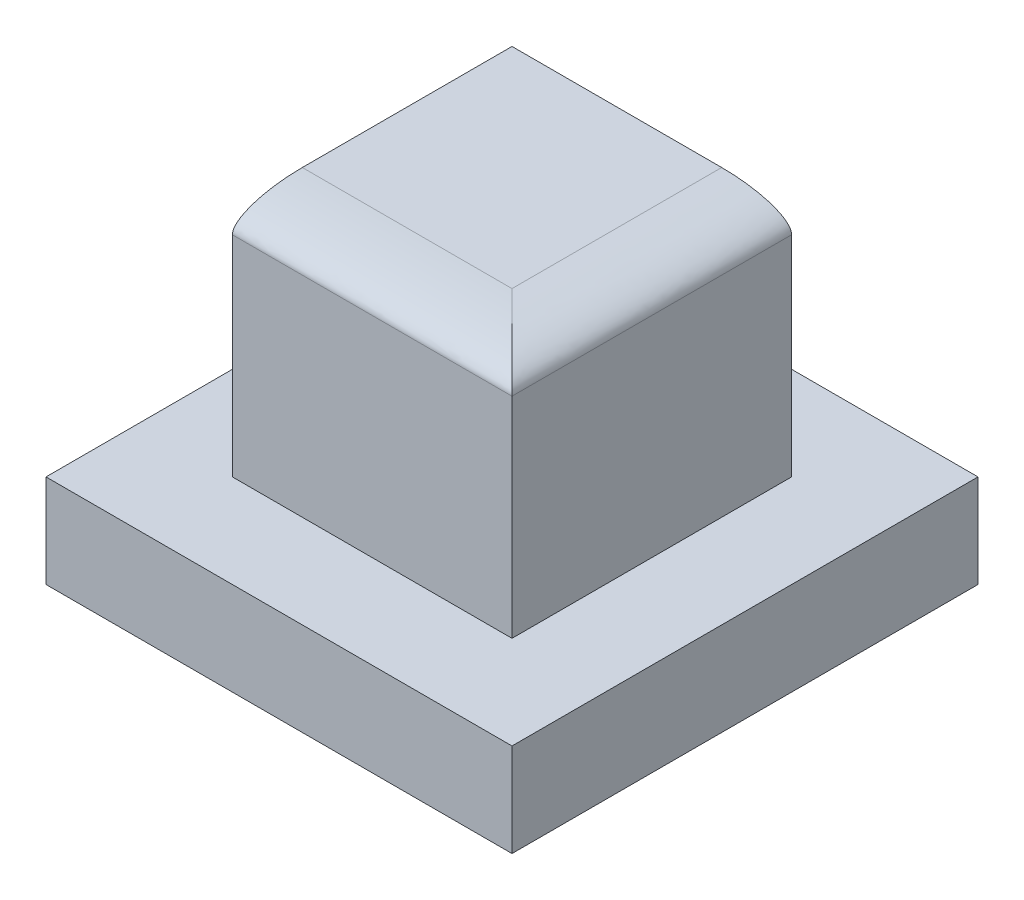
ISO-10303-21;
HEADER;
FILE_DESCRIPTION(('STEP AP214'),'2;1');
FILE_NAME('part.step','',(''),(''),'','','');
FILE_SCHEMA(('AUTOMOTIVE_DESIGN { 1 0 10303 214 1 1 1 1 }'));
ENDSEC;
DATA;
#1=APPLICATION_CONTEXT('core data for automotive mechanical design processes');
#2=APPLICATION_PROTOCOL_DEFINITION('international standard','automotive_design',2000,#1);
#3=PRODUCT_CONTEXT('',#1,'mechanical');
#4=PRODUCT('Part','Part','',(#3));
#5=PRODUCT_RELATED_PRODUCT_CATEGORY('part','',(#4));
#6=PRODUCT_DEFINITION_FORMATION('','',#4);
#7=PRODUCT_DEFINITION_CONTEXT('part definition',#1,'design');
#8=PRODUCT_DEFINITION('design','',#6,#7);
#9=PRODUCT_DEFINITION_SHAPE('','',#8);
#10=(LENGTH_UNIT() NAMED_UNIT(*) SI_UNIT(.MILLI.,.METRE.));
#11=(NAMED_UNIT(*) PLANE_ANGLE_UNIT() SI_UNIT($,.RADIAN.));
#12=(NAMED_UNIT(*) SI_UNIT($,.STERADIAN.) SOLID_ANGLE_UNIT());
#13=UNCERTAINTY_MEASURE_WITH_UNIT(LENGTH_MEASURE(1.E-05),#10,'distance_accuracy_value','');
#14=(GEOMETRIC_REPRESENTATION_CONTEXT(3) GLOBAL_UNCERTAINTY_ASSIGNED_CONTEXT((#13)) GLOBAL_UNIT_ASSIGNED_CONTEXT((#10,
#11,#12)) REPRESENTATION_CONTEXT('',''));
#15=CARTESIAN_POINT('',(0.,0.,0.));
#16=DIRECTION('',(0.,0.,1.));
#17=DIRECTION('',(1.,0.,0.));
#18=AXIS2_PLACEMENT_3D('',#15,#16,#17);
#19=CARTESIAN_POINT('',(-50.,20.,50.));
#20=DIRECTION('',(0.,-1.,0.));
#21=DIRECTION('',(1.,0.,0.));
#22=AXIS2_PLACEMENT_3D('',#19,#20,#21);
#23=PLANE('',#22);
#24=DIRECTION('',(-1.,0.,0.));
#25=VECTOR('',#24,1.);
#26=CARTESIAN_POINT('',(-50.,20.,-50.));
#27=LINE('',#26,#25);
#28=CARTESIAN_POINT('',(50.,20.,-50.));
#29=VERTEX_POINT('',#28);
#30=CARTESIAN_POINT('',(-50.,20.,-50.));
#31=VERTEX_POINT('',#30);
#32=EDGE_CURVE('E309',#29,#31,#27,.T.);
#33=ORIENTED_EDGE('',*,*,#32,.T.);
#34=DIRECTION('',(0.,0.,-1.));
#35=VECTOR('',#34,1.);
#36=CARTESIAN_POINT('',(-50.,20.,50.));
#37=LINE('',#36,#35);
#38=CARTESIAN_POINT('',(-50.,20.,50.));
#39=VERTEX_POINT('',#38);
#40=EDGE_CURVE('E297',#39,#31,#37,.T.);
#41=ORIENTED_EDGE('',*,*,#40,.F.);
#42=DIRECTION('',(-1.,0.,0.));
#43=VECTOR('',#42,1.);
#44=CARTESIAN_POINT('',(-50.,20.,50.));
#45=LINE('',#44,#43);
#46=CARTESIAN_POINT('',(50.,20.,50.));
#47=VERTEX_POINT('',#46);
#48=EDGE_CURVE('E300',#47,#39,#45,.T.);
#49=ORIENTED_EDGE('',*,*,#48,.F.);
#50=DIRECTION('',(0.,0.,-1.));
#51=VECTOR('',#50,1.);
#52=CARTESIAN_POINT('',(50.,20.,50.));
#53=LINE('',#52,#51);
#54=EDGE_CURVE('E292',#47,#29,#53,.T.);
#55=ORIENTED_EDGE('',*,*,#54,.T.);
#56=EDGE_LOOP('',(#33,#41,#49,#55));
#57=FACE_BOUND('',#56,.T.);
#58=DIRECTION('',(0.,0.,-1.));
#59=VECTOR('',#58,1.);
#60=CARTESIAN_POINT('',(30.,20.,30.));
#61=LINE('',#60,#59);
#62=CARTESIAN_POINT('',(30.,20.,30.));
#63=VERTEX_POINT('',#62);
#64=CARTESIAN_POINT('',(30.,20.,-30.));
#65=VERTEX_POINT('',#64);
#66=EDGE_CURVE('E156',#63,#65,#61,.T.);
#67=ORIENTED_EDGE('',*,*,#66,.F.);
#68=DIRECTION('',(1.,0.,0.));
#69=VECTOR('',#68,1.);
#70=CARTESIAN_POINT('',(30.,20.,30.));
#71=LINE('',#70,#69);
#72=CARTESIAN_POINT('',(-30.,20.,30.));
#73=VERTEX_POINT('',#72);
#74=EDGE_CURVE('E129',#73,#63,#71,.T.);
#75=ORIENTED_EDGE('',*,*,#74,.F.);
#76=DIRECTION('',(0.,0.,1.));
#77=VECTOR('',#76,1.);
#78=CARTESIAN_POINT('',(-30.,20.,30.));
#79=LINE('',#78,#77);
#80=CARTESIAN_POINT('',(-30.,20.,-30.));
#81=VERTEX_POINT('',#80);
#82=EDGE_CURVE('E161',#81,#73,#79,.T.);
#83=ORIENTED_EDGE('',*,*,#82,.F.);
#84=DIRECTION('',(-1.,0.,0.));
#85=VECTOR('',#84,1.);
#86=CARTESIAN_POINT('',(30.,20.,-30.));
#87=LINE('',#86,#85);
#88=EDGE_CURVE('E136',#65,#81,#87,.T.);
#89=ORIENTED_EDGE('',*,*,#88,.F.);
#90=EDGE_LOOP('',(#67,#75,#83,#89));
#91=FACE_BOUND('',#90,.T.);
#92=ADVANCED_FACE('F37',(#57,#91),#23,.F.);
#93=CARTESIAN_POINT('',(-50.,20.,50.));
#94=DIRECTION('',(1.,0.,0.));
#95=DIRECTION('',(0.,1.,0.));
#96=AXIS2_PLACEMENT_3D('',#93,#94,#95);
#97=PLANE('',#96);
#98=DIRECTION('',(0.,-1.,0.));
#99=VECTOR('',#98,1.);
#100=CARTESIAN_POINT('',(-50.,20.,-50.));
#101=LINE('',#100,#99);
#102=CARTESIAN_POINT('',(-50.,0.,-50.));
#103=VERTEX_POINT('',#102);
#104=EDGE_CURVE('E315',#31,#103,#101,.T.);
#105=ORIENTED_EDGE('',*,*,#104,.T.);
#106=DIRECTION('',(0.,0.,-1.));
#107=VECTOR('',#106,1.);
#108=CARTESIAN_POINT('',(-50.,0.,50.));
#109=LINE('',#108,#107);
#110=CARTESIAN_POINT('',(-50.,0.,50.));
#111=VERTEX_POINT('',#110);
#112=EDGE_CURVE('E286',#111,#103,#109,.T.);
#113=ORIENTED_EDGE('',*,*,#112,.F.);
#114=DIRECTION('',(0.,-1.,0.));
#115=VECTOR('',#114,1.);
#116=CARTESIAN_POINT('',(-50.,20.,50.));
#117=LINE('',#116,#115);
#118=EDGE_CURVE('E306',#39,#111,#117,.T.);
#119=ORIENTED_EDGE('',*,*,#118,.F.);
#120=ORIENTED_EDGE('',*,*,#40,.T.);
#121=EDGE_LOOP('',(#105,#113,#119,#120));
#122=FACE_BOUND('',#121,.T.);
#123=ADVANCED_FACE('F200',(#122),#97,.F.);
#124=CARTESIAN_POINT('',(-50.,0.,50.));
#125=DIRECTION('',(0.,1.,0.));
#126=DIRECTION('',(0.,0.,1.));
#127=AXIS2_PLACEMENT_3D('',#124,#125,#126);
#128=PLANE('',#127);
#129=DIRECTION('',(1.,0.,0.));
#130=VECTOR('',#129,1.);
#131=CARTESIAN_POINT('',(-50.,0.,-50.));
#132=LINE('',#131,#130);
#133=CARTESIAN_POINT('',(50.,0.,-50.));
#134=VERTEX_POINT('',#133);
#135=EDGE_CURVE('E313',#103,#134,#132,.T.);
#136=ORIENTED_EDGE('',*,*,#135,.T.);
#137=DIRECTION('',(0.,0.,-1.));
#138=VECTOR('',#137,1.);
#139=CARTESIAN_POINT('',(50.,0.,50.));
#140=LINE('',#139,#138);
#141=CARTESIAN_POINT('',(50.,0.,50.));
#142=VERTEX_POINT('',#141);
#143=EDGE_CURVE('E288',#142,#134,#140,.T.);
#144=ORIENTED_EDGE('',*,*,#143,.F.);
#145=DIRECTION('',(1.,0.,0.));
#146=VECTOR('',#145,1.);
#147=CARTESIAN_POINT('',(-50.,0.,50.));
#148=LINE('',#147,#146);
#149=EDGE_CURVE('E304',#111,#142,#148,.T.);
#150=ORIENTED_EDGE('',*,*,#149,.F.);
#151=ORIENTED_EDGE('',*,*,#112,.T.);
#152=EDGE_LOOP('',(#136,#144,#150,#151));
#153=FACE_BOUND('',#152,.T.);
#154=ADVANCED_FACE('F204',(#153),#128,.F.);
#155=CARTESIAN_POINT('',(50.,20.,50.));
#156=DIRECTION('',(-1.,0.,0.));
#157=DIRECTION('',(0.,0.,1.));
#158=AXIS2_PLACEMENT_3D('',#155,#156,#157);
#159=PLANE('',#158);
#160=DIRECTION('',(0.,1.,0.));
#161=VECTOR('',#160,1.);
#162=CARTESIAN_POINT('',(50.,20.,-50.));
#163=LINE('',#162,#161);
#164=EDGE_CURVE('E311',#134,#29,#163,.T.);
#165=ORIENTED_EDGE('',*,*,#164,.T.);
#166=ORIENTED_EDGE('',*,*,#54,.F.);
#167=DIRECTION('',(0.,1.,0.));
#168=VECTOR('',#167,1.);
#169=CARTESIAN_POINT('',(50.,20.,50.));
#170=LINE('',#169,#168);
#171=EDGE_CURVE('E302',#142,#47,#170,.T.);
#172=ORIENTED_EDGE('',*,*,#171,.F.);
#173=ORIENTED_EDGE('',*,*,#143,.T.);
#174=EDGE_LOOP('',(#165,#166,#172,#173));
#175=FACE_BOUND('',#174,.T.);
#176=ADVANCED_FACE('F196',(#175),#159,.F.);
#177=CARTESIAN_POINT('',(-50.,20.,50.));
#178=DIRECTION('',(0.,0.,1.));
#179=DIRECTION('',(1.,0.,0.));
#180=AXIS2_PLACEMENT_3D('',#177,#178,#179);
#181=PLANE('',#180);
#182=ORIENTED_EDGE('',*,*,#118,.T.);
#183=ORIENTED_EDGE('',*,*,#149,.T.);
#184=ORIENTED_EDGE('',*,*,#171,.T.);
#185=ORIENTED_EDGE('',*,*,#48,.T.);
#186=EDGE_LOOP('',(#182,#183,#184,#185));
#187=FACE_BOUND('',#186,.T.);
#188=ADVANCED_FACE('F192',(#187),#181,.T.);
#189=CARTESIAN_POINT('',(-50.,20.,-50.));
#190=DIRECTION('',(0.,0.,1.));
#191=DIRECTION('',(1.,0.,0.));
#192=AXIS2_PLACEMENT_3D('',#189,#190,#191);
#193=PLANE('',#192);
#194=ORIENTED_EDGE('',*,*,#104,.F.);
#195=ORIENTED_EDGE('',*,*,#32,.F.);
#196=ORIENTED_EDGE('',*,*,#164,.F.);
#197=ORIENTED_EDGE('',*,*,#135,.F.);
#198=EDGE_LOOP('',(#194,#195,#196,#197));
#199=FACE_BOUND('',#198,.T.);
#200=ADVANCED_FACE('F187',(#199),#193,.F.);
#201=CARTESIAN_POINT('',(30.,70.,30.));
#202=DIRECTION('',(-1.,0.,0.));
#203=DIRECTION('',(0.,-1.,0.));
#204=AXIS2_PLACEMENT_3D('',#201,#202,#203);
#205=PLANE('',#204);
#206=DIRECTION('',(0.,-1.,0.));
#207=VECTOR('',#206,1.);
#208=CARTESIAN_POINT('',(30.,70.,-30.));
#209=LINE('',#208,#207);
#210=CARTESIAN_POINT('',(30.,65.,-30.));
#211=VERTEX_POINT('',#210);
#212=EDGE_CURVE('E139',#211,#65,#209,.T.);
#213=ORIENTED_EDGE('',*,*,#212,.F.);
#214=CARTESIAN_POINT('',(30.,65.,33.));
#215=CARTESIAN_POINT('',(30.,65.,27.));
#216=CARTESIAN_POINT('',(30.,65.,21.));
#217=CARTESIAN_POINT('',(30.,65.,-1.00000000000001));
#218=CARTESIAN_POINT('',(30.,65.,-17.));
#219=CARTESIAN_POINT('',(30.,65.,-33.));
#220=(BOUNDED_CURVE() B_SPLINE_CURVE(3,(#214,#215,#216,#217,#218,#219),.UNSPECIFIED.,.F.,
.F.) B_SPLINE_CURVE_WITH_KNOTS((4,2,4),(-0.003,0.015,0.063),
.UNSPECIFIED.) CURVE() GEOMETRIC_REPRESENTATION_ITEM() RATIONAL_B_SPLINE_CURVE((1.,1.,1.,1.,1.,1.)) REPRESENTATION_ITEM(''));
#221=CARTESIAN_POINT('',(30.,65.,30.));
#222=VERTEX_POINT('',#221);
#223=EDGE_CURVE('E66',#211,#222,#220,.F.);
#224=ORIENTED_EDGE('',*,*,#223,.T.);
#225=DIRECTION('',(0.,-1.,0.));
#226=VECTOR('',#225,1.);
#227=CARTESIAN_POINT('',(30.,70.,30.));
#228=LINE('',#227,#226);
#229=EDGE_CURVE('E145',#222,#63,#228,.T.);
#230=ORIENTED_EDGE('',*,*,#229,.T.);
#231=ORIENTED_EDGE('',*,*,#66,.T.);
#232=EDGE_LOOP('',(#213,#224,#230,#231));
#233=FACE_BOUND('',#232,.T.);
#234=ADVANCED_FACE('F178',(#233),#205,.F.);
#235=CARTESIAN_POINT('',(30.,70.,-30.));
#236=DIRECTION('',(0.,0.,1.));
#237=DIRECTION('',(1.,0.,0.));
#238=AXIS2_PLACEMENT_3D('',#235,#236,#237);
#239=PLANE('',#238);
#240=DIRECTION('',(-1.,0.,0.));
#241=VECTOR('',#240,1.);
#242=CARTESIAN_POINT('',(30.,70.,-30.));
#243=LINE('',#242,#241);
#244=CARTESIAN_POINT('',(15.,70.,-30.));
#245=VERTEX_POINT('',#244);
#246=CARTESIAN_POINT('',(-30.,70.,-30.));
#247=VERTEX_POINT('',#246);
#248=EDGE_CURVE('E119',#245,#247,#243,.T.);
#249=ORIENTED_EDGE('',*,*,#248,.F.);
#250=CARTESIAN_POINT('',(30.,65.,-30.));
#251=CARTESIAN_POINT('',(30.,70.,-30.));
#252=CARTESIAN_POINT('',(15.,70.,-30.));
#253=(BOUNDED_CURVE() B_SPLINE_CURVE(2,(#250,#251,#252),.UNSPECIFIED.,.F.,
.F.) B_SPLINE_CURVE_WITH_KNOTS((3,3),(0.,1.),
.UNSPECIFIED.) CURVE() GEOMETRIC_REPRESENTATION_ITEM() RATIONAL_B_SPLINE_CURVE((1.,
0.707106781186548,1.)) REPRESENTATION_ITEM(''));
#254=EDGE_CURVE('E285',#245,#211,#253,.F.);
#255=ORIENTED_EDGE('',*,*,#254,.T.);
#256=ORIENTED_EDGE('',*,*,#212,.T.);
#257=ORIENTED_EDGE('',*,*,#88,.T.);
#258=DIRECTION('',(0.,-1.,0.));
#259=VECTOR('',#258,1.);
#260=CARTESIAN_POINT('',(-30.,70.,-30.));
#261=LINE('',#260,#259);
#262=EDGE_CURVE('E133',#247,#81,#261,.T.);
#263=ORIENTED_EDGE('',*,*,#262,.F.);
#264=EDGE_LOOP('',(#249,#255,#256,#257,#263));
#265=FACE_BOUND('',#264,.T.);
#266=ADVANCED_FACE('F134',(#265),#239,.F.);
#267=CARTESIAN_POINT('',(-30.,70.,30.));
#268=DIRECTION('',(1.,0.,0.));
#269=DIRECTION('',(0.,1.,0.));
#270=AXIS2_PLACEMENT_3D('',#267,#268,#269);
#271=PLANE('',#270);
#272=DIRECTION('',(0.,-1.,0.));
#273=VECTOR('',#272,1.);
#274=CARTESIAN_POINT('',(-30.,70.,30.));
#275=LINE('',#274,#273);
#276=CARTESIAN_POINT('',(-30.,65.,30.));
#277=VERTEX_POINT('',#276);
#278=EDGE_CURVE('E140',#277,#73,#275,.T.);
#279=ORIENTED_EDGE('',*,*,#278,.F.);
#280=CARTESIAN_POINT('',(-30.,70.,15.));
#281=CARTESIAN_POINT('',(-30.,70.,29.9999999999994));
#282=CARTESIAN_POINT('',(-30.,65.,30.));
#283=(BOUNDED_CURVE() B_SPLINE_CURVE(2,(#280,#281,#282),.UNSPECIFIED.,.F.,
.F.) B_SPLINE_CURVE_WITH_KNOTS((3,3),(0.,1.),
.UNSPECIFIED.) CURVE() GEOMETRIC_REPRESENTATION_ITEM() RATIONAL_B_SPLINE_CURVE((1.,
0.707106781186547,1.)) REPRESENTATION_ITEM(''));
#284=CARTESIAN_POINT('',(-30.,70.,15.));
#285=VERTEX_POINT('',#284);
#286=EDGE_CURVE('E12',#277,#285,#283,.F.);
#287=ORIENTED_EDGE('',*,*,#286,.T.);
#288=DIRECTION('',(0.,0.,1.));
#289=VECTOR('',#288,1.);
#290=CARTESIAN_POINT('',(-30.,70.,30.));
#291=LINE('',#290,#289);
#292=EDGE_CURVE('E123',#247,#285,#291,.T.);
#293=ORIENTED_EDGE('',*,*,#292,.F.);
#294=ORIENTED_EDGE('',*,*,#262,.T.);
#295=ORIENTED_EDGE('',*,*,#82,.T.);
#296=EDGE_LOOP('',(#279,#287,#293,#294,#295));
#297=FACE_BOUND('',#296,.T.);
#298=ADVANCED_FACE('F142',(#297),#271,.F.);
#299=CARTESIAN_POINT('',(30.,70.,30.));
#300=DIRECTION('',(0.,0.,-1.));
#301=DIRECTION('',(-1.,0.,0.));
#302=AXIS2_PLACEMENT_3D('',#299,#300,#301);
#303=PLANE('',#302);
#304=ORIENTED_EDGE('',*,*,#229,.F.);
#305=CARTESIAN_POINT('',(-33.,65.,30.));
#306=CARTESIAN_POINT('',(-17.,65.,30.));
#307=CARTESIAN_POINT('',(-0.99999999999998,65.,30.));
#308=CARTESIAN_POINT('',(21.,65.,30.));
#309=CARTESIAN_POINT('',(27.,65.,30.));
#310=CARTESIAN_POINT('',(33.,65.,30.));
#311=(BOUNDED_CURVE() B_SPLINE_CURVE(3,(#305,#306,#307,#308,#309,#310),.UNSPECIFIED.,.F.,
.F.) B_SPLINE_CURVE_WITH_KNOTS((4,2,4),(-0.00300000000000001,0.045,0.063),
.UNSPECIFIED.) CURVE() GEOMETRIC_REPRESENTATION_ITEM() RATIONAL_B_SPLINE_CURVE((1.,1.,1.,1.,1.,1.)) REPRESENTATION_ITEM(''));
#312=EDGE_CURVE('E51',#222,#277,#311,.F.);
#313=ORIENTED_EDGE('',*,*,#312,.T.);
#314=ORIENTED_EDGE('',*,*,#278,.T.);
#315=ORIENTED_EDGE('',*,*,#74,.T.);
#316=EDGE_LOOP('',(#304,#313,#314,#315));
#317=FACE_BOUND('',#316,.T.);
#318=ADVANCED_FACE('F326',(#317),#303,.F.);
#319=CARTESIAN_POINT('',(30.,70.,-30.));
#320=DIRECTION('',(0.,1.,0.));
#321=DIRECTION('',(-1.,0.,0.));
#322=AXIS2_PLACEMENT_3D('',#319,#320,#321);
#323=PLANE('',#322);
#324=CARTESIAN_POINT('',(33.,70.,15.));
#325=CARTESIAN_POINT('',(27.,70.,15.));
#326=CARTESIAN_POINT('',(21.,70.,15.));
#327=CARTESIAN_POINT('',(-0.999999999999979,70.,15.));
#328=CARTESIAN_POINT('',(-17.,70.,15.));
#329=CARTESIAN_POINT('',(-33.,70.,15.));
#330=(BOUNDED_CURVE() B_SPLINE_CURVE(3,(#324,#325,#326,#327,#328,#329),.UNSPECIFIED.,.F.,
.F.) B_SPLINE_CURVE_WITH_KNOTS((4,2,4),(-0.00300000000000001,0.015,0.063),
.UNSPECIFIED.) CURVE() GEOMETRIC_REPRESENTATION_ITEM() RATIONAL_B_SPLINE_CURVE((1.,1.,1.,1.,1.,1.)) REPRESENTATION_ITEM(''));
#331=CARTESIAN_POINT('',(15.,70.,15.));
#332=VERTEX_POINT('',#331);
#333=EDGE_CURVE('E268',#285,#332,#330,.F.);
#334=ORIENTED_EDGE('',*,*,#333,.T.);
#335=CARTESIAN_POINT('',(15.,70.,-33.));
#336=CARTESIAN_POINT('',(15.,70.,-17.));
#337=CARTESIAN_POINT('',(15.,70.,-1.00000000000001));
#338=CARTESIAN_POINT('',(15.,70.,21.));
#339=CARTESIAN_POINT('',(15.,70.,27.));
#340=CARTESIAN_POINT('',(15.,70.,33.));
#341=(BOUNDED_CURVE() B_SPLINE_CURVE(3,(#335,#336,#337,#338,#339,#340),.UNSPECIFIED.,.F.,
.F.) B_SPLINE_CURVE_WITH_KNOTS((4,2,4),(-0.003,0.045,0.063),
.UNSPECIFIED.) CURVE() GEOMETRIC_REPRESENTATION_ITEM() RATIONAL_B_SPLINE_CURVE((1.,1.,1.,1.,1.,1.)) REPRESENTATION_ITEM(''));
#342=EDGE_CURVE('E126',#332,#245,#341,.F.);
#343=ORIENTED_EDGE('',*,*,#342,.T.);
#344=ORIENTED_EDGE('',*,*,#248,.T.);
#345=ORIENTED_EDGE('',*,*,#292,.T.);
#346=EDGE_LOOP('',(#334,#343,#344,#345));
#347=FACE_BOUND('',#346,.T.);
#348=ADVANCED_FACE('F121',(#347),#323,.T.);
#349=CARTESIAN_POINT('',(33.,65.,30.));
#350=CARTESIAN_POINT('',(27.,65.,30.));
#351=CARTESIAN_POINT('',(21.,65.,30.));
#352=CARTESIAN_POINT('',(-0.99999999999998,65.,30.));
#353=CARTESIAN_POINT('',(-17.,65.,30.));
#354=CARTESIAN_POINT('',(-33.,65.,30.));
#355=CARTESIAN_POINT('',(33.,70.,30.));
#356=CARTESIAN_POINT('',(27.,70.,30.));
#357=CARTESIAN_POINT('',(21.,70.,30.0000000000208));
#358=CARTESIAN_POINT('',(-0.999999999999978,70.,29.9999999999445));
#359=CARTESIAN_POINT('',(-17.,70.,30.));
#360=CARTESIAN_POINT('',(-33.,70.,30.));
#361=CARTESIAN_POINT('',(33.,70.,15.));
#362=CARTESIAN_POINT('',(27.,70.,15.));
#363=CARTESIAN_POINT('',(21.,70.,15.));
#364=CARTESIAN_POINT('',(-0.999999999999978,70.,15.));
#365=CARTESIAN_POINT('',(-17.,70.,15.));
#366=CARTESIAN_POINT('',(-33.,70.,15.));
#367=(BOUNDED_SURFACE() B_SPLINE_SURFACE(2,3,((#349,#350,#351,#352,#353,#354),(#355,#356,#357,
#358,#359,#360),(#361,#362,#363,#364,#365,#366)),.UNSPECIFIED.,.F.,.F.,
.F.) B_SPLINE_SURFACE_WITH_KNOTS((3,3),(4,2,4),(0.,1.),(-0.00300000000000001,0.015,0.063),
.UNSPECIFIED.) GEOMETRIC_REPRESENTATION_ITEM() RATIONAL_B_SPLINE_SURFACE(((1.,1.,1.,1.,1.,1.),
(0.707106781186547,0.707106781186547,0.707106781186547,0.707106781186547,0.707106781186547,
0.707106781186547),(1.,1.,1.,1.,1.,1.))) REPRESENTATION_ITEM('') SURFACE());
#368=CARTESIAN_POINT('',(15.,70.,15.));
#369=CARTESIAN_POINT('',(15.1342022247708,69.9999993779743,15.1342116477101));
#370=CARTESIAN_POINT('',(15.2683933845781,69.9993996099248,15.2684344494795));
#371=CARTESIAN_POINT('',(15.5445805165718,69.9969282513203,15.5446890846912));
#372=CARTESIAN_POINT('',(15.6865760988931,69.9949846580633,15.6867206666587));
#373=CARTESIAN_POINT('',(15.9784173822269,69.9896026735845,15.978587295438));
#374=CARTESIAN_POINT('',(16.1282637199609,69.9860876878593,16.128420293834));
#375=CARTESIAN_POINT('',(16.4357909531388,69.9773214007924,16.4358976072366));
#376=CARTESIAN_POINT('',(16.5934712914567,69.9719888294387,16.593540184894));
#377=CARTESIAN_POINT('',(16.8329059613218,69.9626071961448,16.8329115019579));
#378=CARTESIAN_POINT('',(16.9146711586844,69.9591759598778,16.9146539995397));
#379=CARTESIAN_POINT('',(17.0459282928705,69.9533005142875,17.0459386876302));
#380=CARTESIAN_POINT('',(17.0954360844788,69.9510004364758,17.0954715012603));
#381=CARTESIAN_POINT('',(17.2621148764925,69.9429731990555,17.2622720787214));
#382=CARTESIAN_POINT('',(17.3792510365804,69.9368600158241,17.3795563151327));
#383=CARTESIAN_POINT('',(17.6378648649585,69.9223103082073,17.6383924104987));
#384=CARTESIAN_POINT('',(17.779347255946,69.9136549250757,17.7799272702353));
#385=CARTESIAN_POINT('',(18.0867321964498,69.8933138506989,18.0872674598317));
#386=CARTESIAN_POINT('',(18.2526396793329,69.8813629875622,18.253050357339));
#387=CARTESIAN_POINT('',(18.6087333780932,69.8535808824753,18.6089169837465));
#388=CARTESIAN_POINT('',(18.79890449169,69.8374374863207,18.7989915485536));
#389=CARTESIAN_POINT('',(19.1726454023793,69.803069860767,19.1725613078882));
#390=CARTESIAN_POINT('',(19.3562196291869,69.7849351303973,19.3560602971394));
#391=CARTESIAN_POINT('',(19.7026974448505,69.7482611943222,19.7023401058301));
#392=CARTESIAN_POINT('',(19.8656123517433,69.7299949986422,19.8651385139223));
#393=CARTESIAN_POINT('',(20.1706013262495,69.693821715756,20.1700755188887));
#394=CARTESIAN_POINT('',(20.3127006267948,69.6761623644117,20.3122182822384));
#395=CARTESIAN_POINT('',(20.5761246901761,69.641884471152,20.575839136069));
#396=CARTESIAN_POINT('',(20.6974722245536,69.6254866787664,20.6973231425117));
#397=CARTESIAN_POINT('',(20.8717630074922,69.6010348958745,20.8717296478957));
#398=CARTESIAN_POINT('',(20.9247192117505,69.5934861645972,20.924710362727));
#399=CARTESIAN_POINT('',(21.0602930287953,69.5738503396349,21.0603068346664));
#400=CARTESIAN_POINT('',(21.142909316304,69.5615896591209,21.142898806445));
#401=CARTESIAN_POINT('',(21.3839403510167,69.5249387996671,21.3838536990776));
#402=CARTESIAN_POINT('',(21.5422970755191,69.4997486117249,21.5421538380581));
#403=CARTESIAN_POINT('',(21.8497680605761,69.4485764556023,21.8495519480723));
#404=CARTESIAN_POINT('',(21.9988939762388,69.4227217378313,21.9986594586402));
#405=CARTESIAN_POINT('',(22.2878810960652,69.3705090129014,22.2876797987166));
#406=CARTESIAN_POINT('',(22.4277557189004,69.3442766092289,22.4276018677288));
#407=CARTESIAN_POINT('',(22.6982998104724,69.2915824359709,22.6982431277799));
#408=CARTESIAN_POINT('',(22.8289815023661,69.2652444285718,22.8289741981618));
#409=CARTESIAN_POINT('',(23.1189698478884,69.2047286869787,23.1189787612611));
#410=CARTESIAN_POINT('',(23.2782401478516,69.1701021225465,23.2781953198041));
#411=CARTESIAN_POINT('',(23.5888888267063,69.0996556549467,23.5887542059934));
#412=CARTESIAN_POINT('',(23.7402828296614,69.0639704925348,23.7401114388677));
#413=CARTESIAN_POINT('',(24.0351383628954,68.9916313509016,24.0349459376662));
#414=CARTESIAN_POINT('',(24.1786180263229,68.9551150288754,24.1784388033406));
#415=CARTESIAN_POINT('',(24.4576582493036,68.8813332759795,24.4575458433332));
#416=CARTESIAN_POINT('',(24.5932383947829,68.8442082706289,24.5931774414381));
#417=CARTESIAN_POINT('',(24.793527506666,68.7873191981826,24.7935151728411));
#418=CARTESIAN_POINT('',(24.8583756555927,68.7685820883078,24.8583748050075));
#419=CARTESIAN_POINT('',(25.0041622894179,68.7257124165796,25.0041633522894));
#420=CARTESIAN_POINT('',(25.0850773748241,68.7014003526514,25.0850628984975));
#421=CARTESIAN_POINT('',(25.3211851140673,68.6288621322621,25.321108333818));
#422=CARTESIAN_POINT('',(25.4761710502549,68.5792282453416,25.4760319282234));
#423=CARTESIAN_POINT('',(25.7768798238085,68.4785332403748,25.7766637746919));
#424=CARTESIAN_POINT('',(25.922642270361,68.4277016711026,25.9224091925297));
#425=CARTESIAN_POINT('',(26.2048842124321,68.3248511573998,26.2046819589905));
#426=CARTESIAN_POINT('',(26.3414094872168,68.2730741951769,26.3412513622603));
#427=CARTESIAN_POINT('',(26.6052201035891,68.168564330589,26.6051655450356));
#428=CARTESIAN_POINT('',(26.7325565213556,68.1160868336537,26.732560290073));
#429=CARTESIAN_POINT('',(27.0227689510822,67.9911775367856,27.0227641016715));
#430=CARTESIAN_POINT('',(27.1853654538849,67.9173388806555,27.185252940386));
#431=CARTESIAN_POINT('',(27.496035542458,67.7672301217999,27.4957209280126));
#432=CARTESIAN_POINT('',(27.6442603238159,67.6915890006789,27.6438508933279));
#433=CARTESIAN_POINT('',(27.9260394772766,67.53824328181,27.9255750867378));
#434=CARTESIAN_POINT('',(28.0597875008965,67.4612352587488,28.0593524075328));
#435=CARTESIAN_POINT('',(28.3126232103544,67.3055076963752,28.3123515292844));
#436=CARTESIAN_POINT('',(28.4319503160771,67.2275604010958,28.4318031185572));
#437=CARTESIAN_POINT('',(28.6042440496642,67.1066200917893,28.6042128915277));
#438=CARTESIAN_POINT('',(28.6584828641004,67.0672972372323,28.6584787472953));
#439=CARTESIAN_POINT('',(28.7502670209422,66.9983030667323,28.7502699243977));
#440=CARTESIAN_POINT('',(28.7880209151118,66.969202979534,28.7880153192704));
#441=CARTESIAN_POINT('',(28.8617517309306,66.9108039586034,28.8617262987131));
#442=CARTESIAN_POINT('',(28.897745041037,66.8815464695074,28.8977083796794));
#443=CARTESIAN_POINT('',(29.0011731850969,66.7950745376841,29.0011039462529));
#444=CARTESIAN_POINT('',(29.0679448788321,66.7362537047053,29.0678542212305));
#445=CARTESIAN_POINT('',(29.1942524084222,66.61782183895,29.1941490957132));
#446=CARTESIAN_POINT('',(29.2539611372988,66.5585800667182,29.253864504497));
#447=CARTESIAN_POINT('',(29.3530497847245,66.4532919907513,29.352984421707));
#448=CARTESIAN_POINT('',(29.3931568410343,66.4086155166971,29.3931100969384));
#449=CARTESIAN_POINT('',(29.4511279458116,66.3403823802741,29.4511053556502));
#450=CARTESIAN_POINT('',(29.4696713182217,66.3179786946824,29.4696560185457));
#451=CARTESIAN_POINT('',(29.5057561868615,66.2731301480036,29.5057529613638));
#452=CARTESIAN_POINT('',(29.523311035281,66.2507068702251,29.5233126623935));
#453=CARTESIAN_POINT('',(29.5615315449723,66.2004186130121,29.5615295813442));
#454=CARTESIAN_POINT('',(29.5820896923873,66.1723873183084,29.5820763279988));
#455=CARTESIAN_POINT('',(29.6217202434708,66.1161710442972,29.6216653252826));
#456=CARTESIAN_POINT('',(29.6408194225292,66.0880243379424,29.6407350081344));
#457=CARTESIAN_POINT('',(29.6775206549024,66.0315915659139,29.6773699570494));
#458=CARTESIAN_POINT('',(29.6951515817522,66.0033433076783,29.694964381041));
#459=CARTESIAN_POINT('',(29.7289071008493,65.9467216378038,29.7286465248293));
#460=CARTESIAN_POINT('',(29.7450625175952,65.9183850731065,29.7447651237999));
#461=CARTESIAN_POINT('',(29.7758593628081,65.8616018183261,29.7754940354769));
#462=CARTESIAN_POINT('',(29.7905333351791,65.8331904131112,29.7901367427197));
#463=CARTESIAN_POINT('',(29.8183615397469,65.7762730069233,29.8179123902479));
#464=CARTESIAN_POINT('',(29.8315496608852,65.7478000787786,29.8310789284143));
#465=CARTESIAN_POINT('',(29.8564022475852,65.690776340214,29.8559010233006));
#466=CARTESIAN_POINT('',(29.8681014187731,65.662255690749,29.8675909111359));
#467=CARTESIAN_POINT('',(29.8899747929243,65.6051522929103,29.8894594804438));
#468=CARTESIAN_POINT('',(29.9001837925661,65.5765961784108,29.8996725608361));
#469=CARTESIAN_POINT('',(29.917232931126,65.5250202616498,29.9167409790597));
#470=CARTESIAN_POINT('',(29.9243203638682,65.5021629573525,29.9238409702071));
#471=CARTESIAN_POINT('',(29.9375256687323,65.4564328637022,29.9370787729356));
#472=CARTESIAN_POINT('',(29.9436602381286,65.4335697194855,29.943233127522));
#473=CARTESIAN_POINT('',(29.9549620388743,65.387837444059,29.9545802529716));
#474=CARTESIAN_POINT('',(29.9601448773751,65.3649760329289,29.9597885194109));
#475=CARTESIAN_POINT('',(29.9695467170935,65.319256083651,29.9692447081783));
#476=CARTESIAN_POINT('',(29.973779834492,65.2964033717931,29.9735066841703));
#477=CARTESIAN_POINT('',(29.9812866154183,65.2507097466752,29.9810718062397));
#478=CARTESIAN_POINT('',(29.984572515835,65.2278728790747,29.9843871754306));
#479=CARTESIAN_POINT('',(29.9901904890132,65.1822197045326,29.9900612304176));
#480=CARTESIAN_POINT('',(29.9925325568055,65.1594058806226,29.9924299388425));
#481=CARTESIAN_POINT('',(29.9962685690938,65.1138069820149,29.9962123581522));
#482=CARTESIAN_POINT('',(29.9976699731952,65.0910231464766,29.9976335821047));
#483=CARTESIAN_POINT('',(29.9995343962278,65.0454930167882,29.9995260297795));
#484=CARTESIAN_POINT('',(30.0000021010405,65.022747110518,30.0000019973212));
#485=CARTESIAN_POINT('',(30.,65.,30.));
#486=B_SPLINE_CURVE_WITH_KNOTS('',3,(#368,#369,#370,#371,#372,#373,#374,#375,#376,#377,#378,
#379,#380,#381,#382,#383,#384,#385,#386,#387,#388,#389,#390,#391,#392,#393,#394,#395,#396,#397,
#398,#399,#400,#401,#402,#403,#404,#405,#406,#407,#408,#409,#410,#411,#412,#413,#414,#415,#416,
#417,#418,#419,#420,#421,#422,#423,#424,#425,#426,#427,#428,#429,#430,#431,#432,#433,#434,#435,
#436,#437,#438,#439,#440,#441,#442,#443,#444,#445,#446,#447,#448,#449,#450,#451,#452,#453,#454,
#455,#456,#457,#458,#459,#460,#461,#462,#463,#464,#465,#466,#467,#468,#469,#470,#471,#472,#473,
#474,#475,#476,#477,#478,#479,#480,#481,#482,#483,#484,#485),.UNSPECIFIED.,.F.,.F.,(4,2,2,2,2,2,
2,2,2,2,2,2,2,2,2,2,2,2,2,2,2,2,2,2,2,2,2,2,2,2,2,2,2,2,2,2,2,2,2,2,2,2,2,2,2,2,2,2,2,2,2,2,2,2,
2,2,2,2,4),(0.,0.569391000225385,1.17192727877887,1.80772537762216,2.47681066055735,
2.82381475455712,3.03402473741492,3.53164076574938,4.13256737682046,4.8370936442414,
5.64515596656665,6.42572156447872,7.11882420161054,7.72410916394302,8.24157160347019,
8.46743560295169,8.81981884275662,9.49577476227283,10.1331502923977,10.7318734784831,
11.2920064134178,11.9755400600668,12.6266163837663,13.2451383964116,13.8311274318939,
14.1119603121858,14.4628804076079,15.1369080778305,15.7737753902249,16.373514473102,
16.9363056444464,17.6604798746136,18.3286846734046,18.9412361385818,19.4988769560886,
19.7574880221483,19.9398783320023,20.1159804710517,20.449543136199,20.7588226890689,
20.9753639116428,21.0788375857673,21.1791932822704,21.3003043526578,21.4172599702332,
21.5302089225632,21.6393211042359,21.7447891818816,21.8468301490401,21.9456866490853,
22.041627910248,22.1164843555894,22.1898282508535,22.2618339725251,22.3326856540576,
22.4025761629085,22.4717057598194,22.5402804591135,22.6085101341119),.UNSPECIFIED.);
#487=EDGE_CURVE('E159',#332,#222,#486,.T.);
#488=ORIENTED_EDGE('',*,*,#286,.F.);
#489=ORIENTED_EDGE('',*,*,#312,.F.);
#490=ORIENTED_EDGE('',*,*,#487,.F.);
#491=ORIENTED_EDGE('',*,*,#333,.F.);
#492=EDGE_LOOP('',(#488,#489,#490,#491));
#493=FACE_BOUND('',#492,.T.);
#494=ADVANCED_FACE('F40',(#493),#367,.T.);
#495=CARTESIAN_POINT('',(30.,65.,-33.));
#496=CARTESIAN_POINT('',(30.,65.,-17.));
#497=CARTESIAN_POINT('',(30.,65.,-1.00000000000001));
#498=CARTESIAN_POINT('',(30.,65.,21.));
#499=CARTESIAN_POINT('',(30.,65.,27.));
#500=CARTESIAN_POINT('',(30.,65.,33.));
#501=CARTESIAN_POINT('',(30.,70.,-33.));
#502=CARTESIAN_POINT('',(30.,70.,-17.));
#503=CARTESIAN_POINT('',(30.,70.,-1.00000000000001));
#504=CARTESIAN_POINT('',(30.,70.,21.));
#505=CARTESIAN_POINT('',(30.,70.,27.));
#506=CARTESIAN_POINT('',(30.,70.,33.));
#507=CARTESIAN_POINT('',(15.,70.,-33.));
#508=CARTESIAN_POINT('',(15.,70.,-17.));
#509=CARTESIAN_POINT('',(15.,70.,-1.00000000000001));
#510=CARTESIAN_POINT('',(15.,70.,21.));
#511=CARTESIAN_POINT('',(15.,70.,27.));
#512=CARTESIAN_POINT('',(15.,70.,33.));
#513=(BOUNDED_SURFACE() B_SPLINE_SURFACE(2,3,((#495,#496,#497,#498,#499,#500),(#501,#502,#503,
#504,#505,#506),(#507,#508,#509,#510,#511,#512)),.UNSPECIFIED.,.F.,.F.,
.F.) B_SPLINE_SURFACE_WITH_KNOTS((3,3),(4,2,4),(0.,1.),(-0.003,0.045,0.063),
.UNSPECIFIED.) GEOMETRIC_REPRESENTATION_ITEM() RATIONAL_B_SPLINE_SURFACE(((1.,1.,1.,1.,1.,1.),
(0.707106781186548,0.707106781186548,0.707106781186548,0.707106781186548,0.707106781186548,
0.707106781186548),(1.,1.,1.,1.,1.,1.))) REPRESENTATION_ITEM('') SURFACE());
#514=ORIENTED_EDGE('',*,*,#487,.T.);
#515=ORIENTED_EDGE('',*,*,#223,.F.);
#516=ORIENTED_EDGE('',*,*,#254,.F.);
#517=ORIENTED_EDGE('',*,*,#342,.F.);
#518=EDGE_LOOP('',(#514,#515,#516,#517));
#519=FACE_BOUND('',#518,.T.);
#520=ADVANCED_FACE('F212',(#519),#513,.T.);
#521=CLOSED_SHELL('',(#92,#123,#154,#176,#188,#200,#234,#266,#298,#318,#348,#494,#520));
#522=MANIFOLD_SOLID_BREP('B2',#521);
#523=ADVANCED_BREP_SHAPE_REPRESENTATION('',(#18,#522),#14);
#524=SHAPE_DEFINITION_REPRESENTATION(#9,#523);
ENDSEC;
END-ISO-10303-21;
